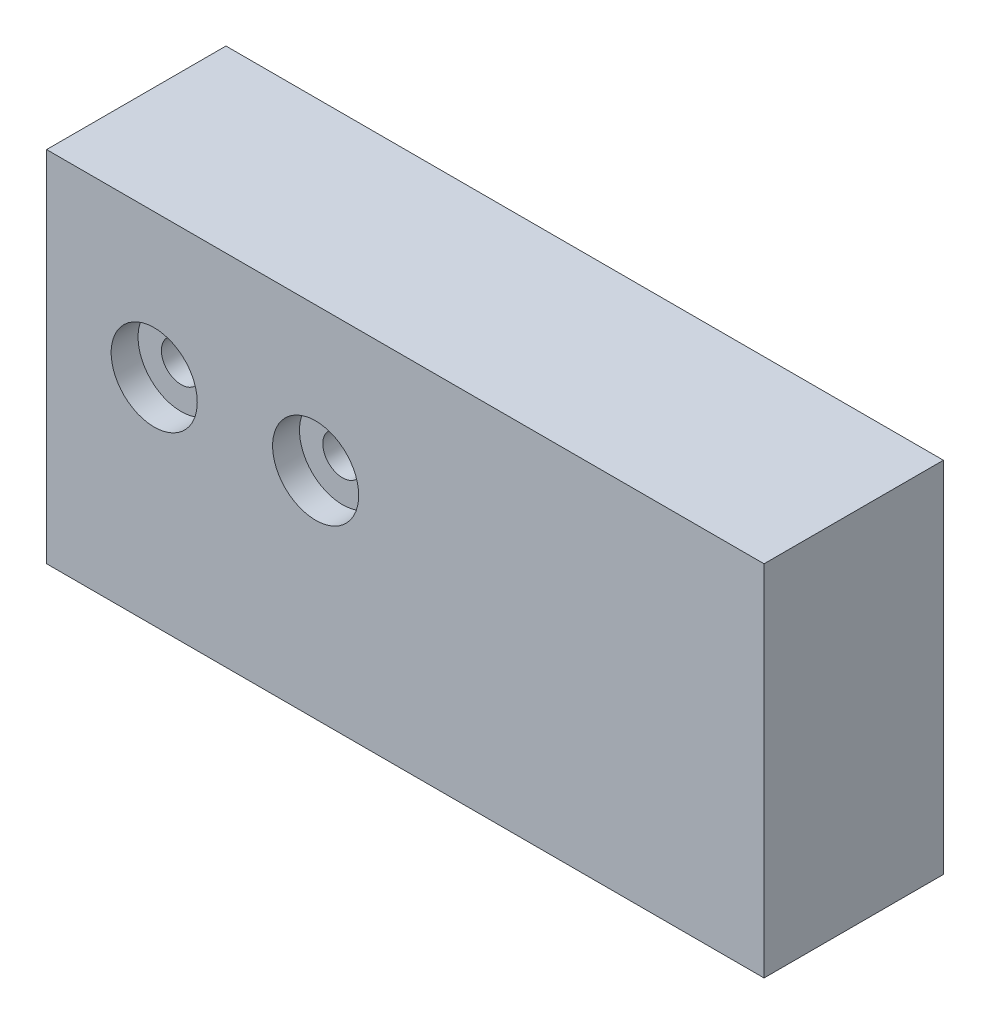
ISO-10303-21;
HEADER;
FILE_DESCRIPTION(('STEP AP214'),'2;1');
FILE_NAME('part.step','',(''),(''),'','','');
FILE_SCHEMA(('AUTOMOTIVE_DESIGN { 1 0 10303 214 1 1 1 1 }'));
ENDSEC;
DATA;
#1=APPLICATION_CONTEXT('core data for automotive mechanical design processes');
#2=APPLICATION_PROTOCOL_DEFINITION('international standard','automotive_design',2000,#1);
#3=PRODUCT_CONTEXT('',#1,'mechanical');
#4=PRODUCT('Part','Part','',(#3));
#5=PRODUCT_RELATED_PRODUCT_CATEGORY('part','',(#4));
#6=PRODUCT_DEFINITION_FORMATION('','',#4);
#7=PRODUCT_DEFINITION_CONTEXT('part definition',#1,'design');
#8=PRODUCT_DEFINITION('design','',#6,#7);
#9=PRODUCT_DEFINITION_SHAPE('','',#8);
#10=(LENGTH_UNIT() NAMED_UNIT(*) SI_UNIT(.MILLI.,.METRE.));
#11=(NAMED_UNIT(*) PLANE_ANGLE_UNIT() SI_UNIT($,.RADIAN.));
#12=(NAMED_UNIT(*) SI_UNIT($,.STERADIAN.) SOLID_ANGLE_UNIT());
#13=UNCERTAINTY_MEASURE_WITH_UNIT(LENGTH_MEASURE(1.E-05),#10,'distance_accuracy_value','');
#14=(GEOMETRIC_REPRESENTATION_CONTEXT(3) GLOBAL_UNCERTAINTY_ASSIGNED_CONTEXT((#13)) GLOBAL_UNIT_ASSIGNED_CONTEXT((#10,
#11,#12)) REPRESENTATION_CONTEXT('',''));
#15=CARTESIAN_POINT('',(0.,0.,0.));
#16=DIRECTION('',(0.,0.,1.));
#17=DIRECTION('',(1.,0.,0.));
#18=AXIS2_PLACEMENT_3D('',#15,#16,#17);
#19=CARTESIAN_POINT('',(-100.,-50.,50.));
#20=DIRECTION('',(1.,0.,0.));
#21=DIRECTION('',(0.,0.,-1.));
#22=AXIS2_PLACEMENT_3D('',#19,#20,#21);
#23=PLANE('',#22);
#24=DIRECTION('',(0.,-1.,0.));
#25=VECTOR('',#24,1.);
#26=CARTESIAN_POINT('',(-100.,-50.,0.));
#27=LINE('',#26,#25);
#28=CARTESIAN_POINT('',(-100.,50.,0.));
#29=VERTEX_POINT('',#28);
#30=CARTESIAN_POINT('',(-100.,-50.,0.));
#31=VERTEX_POINT('',#30);
#32=EDGE_CURVE('E98',#29,#31,#27,.T.);
#33=ORIENTED_EDGE('',*,*,#32,.T.);
#34=DIRECTION('',(0.,0.,-1.));
#35=VECTOR('',#34,1.);
#36=CARTESIAN_POINT('',(-100.,-50.,50.));
#37=LINE('',#36,#35);
#38=CARTESIAN_POINT('',(-100.,-50.,50.));
#39=VERTEX_POINT('',#38);
#40=EDGE_CURVE('E11',#39,#31,#37,.T.);
#41=ORIENTED_EDGE('',*,*,#40,.F.);
#42=DIRECTION('',(0.,-1.,0.));
#43=VECTOR('',#42,1.);
#44=CARTESIAN_POINT('',(-100.,-50.,50.));
#45=LINE('',#44,#43);
#46=CARTESIAN_POINT('',(-100.,50.,50.));
#47=VERTEX_POINT('',#46);
#48=EDGE_CURVE('E86',#47,#39,#45,.T.);
#49=ORIENTED_EDGE('',*,*,#48,.F.);
#50=DIRECTION('',(0.,0.,-1.));
#51=VECTOR('',#50,1.);
#52=CARTESIAN_POINT('',(-100.,50.,50.));
#53=LINE('',#52,#51);
#54=EDGE_CURVE('E94',#47,#29,#53,.T.);
#55=ORIENTED_EDGE('',*,*,#54,.T.);
#56=EDGE_LOOP('',(#33,#41,#49,#55));
#57=FACE_BOUND('',#56,.T.);
#58=ADVANCED_FACE('F35',(#57),#23,.F.);
#59=CARTESIAN_POINT('',(100.,-50.,50.));
#60=DIRECTION('',(0.,1.,0.));
#61=DIRECTION('',(-1.,0.,0.));
#62=AXIS2_PLACEMENT_3D('',#59,#60,#61);
#63=PLANE('',#62);
#64=DIRECTION('',(1.,0.,0.));
#65=VECTOR('',#64,1.);
#66=CARTESIAN_POINT('',(100.,-50.,0.));
#67=LINE('',#66,#65);
#68=CARTESIAN_POINT('',(100.,-50.,0.));
#69=VERTEX_POINT('',#68);
#70=EDGE_CURVE('E90',#31,#69,#67,.T.);
#71=ORIENTED_EDGE('',*,*,#70,.T.);
#72=DIRECTION('',(0.,0.,-1.));
#73=VECTOR('',#72,1.);
#74=CARTESIAN_POINT('',(100.,-50.,50.));
#75=LINE('',#74,#73);
#76=CARTESIAN_POINT('',(100.,-50.,50.));
#77=VERTEX_POINT('',#76);
#78=EDGE_CURVE('E43',#77,#69,#75,.T.);
#79=ORIENTED_EDGE('',*,*,#78,.F.);
#80=DIRECTION('',(1.,0.,0.));
#81=VECTOR('',#80,1.);
#82=CARTESIAN_POINT('',(100.,-50.,50.));
#83=LINE('',#82,#81);
#84=EDGE_CURVE('E81',#39,#77,#83,.T.);
#85=ORIENTED_EDGE('',*,*,#84,.F.);
#86=ORIENTED_EDGE('',*,*,#40,.T.);
#87=EDGE_LOOP('',(#71,#79,#85,#86));
#88=FACE_BOUND('',#87,.T.);
#89=ADVANCED_FACE('F89',(#88),#63,.F.);
#90=CARTESIAN_POINT('',(100.,-50.,50.));
#91=DIRECTION('',(-1.,0.,0.));
#92=DIRECTION('',(0.,0.,1.));
#93=AXIS2_PLACEMENT_3D('',#90,#91,#92);
#94=PLANE('',#93);
#95=DIRECTION('',(0.,1.,0.));
#96=VECTOR('',#95,1.);
#97=CARTESIAN_POINT('',(100.,-50.,0.));
#98=LINE('',#97,#96);
#99=CARTESIAN_POINT('',(100.,50.,0.));
#100=VERTEX_POINT('',#99);
#101=EDGE_CURVE('E68',#69,#100,#98,.T.);
#102=ORIENTED_EDGE('',*,*,#101,.T.);
#103=DIRECTION('',(0.,0.,-1.));
#104=VECTOR('',#103,1.);
#105=CARTESIAN_POINT('',(100.,50.,50.));
#106=LINE('',#105,#104);
#107=CARTESIAN_POINT('',(100.,50.,50.));
#108=VERTEX_POINT('',#107);
#109=EDGE_CURVE('E91',#108,#100,#106,.T.);
#110=ORIENTED_EDGE('',*,*,#109,.F.);
#111=DIRECTION('',(0.,1.,0.));
#112=VECTOR('',#111,1.);
#113=CARTESIAN_POINT('',(100.,-50.,50.));
#114=LINE('',#113,#112);
#115=EDGE_CURVE('E84',#77,#108,#114,.T.);
#116=ORIENTED_EDGE('',*,*,#115,.F.);
#117=ORIENTED_EDGE('',*,*,#78,.T.);
#118=EDGE_LOOP('',(#102,#110,#116,#117));
#119=FACE_BOUND('',#118,.T.);
#120=ADVANCED_FACE('F92',(#119),#94,.F.);
#121=CARTESIAN_POINT('',(100.,50.,50.));
#122=DIRECTION('',(0.,-1.,0.));
#123=DIRECTION('',(1.,0.,0.));
#124=AXIS2_PLACEMENT_3D('',#121,#122,#123);
#125=PLANE('',#124);
#126=DIRECTION('',(-1.,0.,0.));
#127=VECTOR('',#126,1.);
#128=CARTESIAN_POINT('',(100.,50.,0.));
#129=LINE('',#128,#127);
#130=EDGE_CURVE('E74',#100,#29,#129,.T.);
#131=ORIENTED_EDGE('',*,*,#130,.T.);
#132=ORIENTED_EDGE('',*,*,#54,.F.);
#133=DIRECTION('',(-1.,0.,0.));
#134=VECTOR('',#133,1.);
#135=CARTESIAN_POINT('',(100.,50.,50.));
#136=LINE('',#135,#134);
#137=EDGE_CURVE('E51',#108,#47,#136,.T.);
#138=ORIENTED_EDGE('',*,*,#137,.F.);
#139=ORIENTED_EDGE('',*,*,#109,.T.);
#140=EDGE_LOOP('',(#131,#132,#138,#139));
#141=FACE_BOUND('',#140,.T.);
#142=ADVANCED_FACE('F106',(#141),#125,.F.);
#143=CARTESIAN_POINT('',(0.,0.,50.));
#144=DIRECTION('',(0.,0.,1.));
#145=DIRECTION('',(1.,0.,0.));
#146=AXIS2_PLACEMENT_3D('',#143,#144,#145);
#147=PLANE('',#146);
#148=CARTESIAN_POINT('',(-70.,10.,50.));
#149=DIRECTION('',(0.,0.,1.));
#150=DIRECTION('',(1.,0.,0.));
#151=AXIS2_PLACEMENT_3D('',#148,#149,#150);
#152=CIRCLE('',#151,12.);
#153=CARTESIAN_POINT('',(-58.,10.,50.));
#154=VERTEX_POINT('',#153);
#155=EDGE_CURVE('E132',#154,#154,#152,.T.);
#156=ORIENTED_EDGE('',*,*,#155,.F.);
#157=EDGE_LOOP('',(#156));
#158=FACE_BOUND('',#157,.T.);
#159=CARTESIAN_POINT('',(-25.,10.,50.));
#160=DIRECTION('',(0.,0.,1.));
#161=DIRECTION('',(1.,0.,0.));
#162=AXIS2_PLACEMENT_3D('',#159,#160,#161);
#163=CIRCLE('',#162,12.);
#164=CARTESIAN_POINT('',(-13.,10.,50.));
#165=VERTEX_POINT('',#164);
#166=EDGE_CURVE('E120',#165,#165,#163,.T.);
#167=ORIENTED_EDGE('',*,*,#166,.F.);
#168=EDGE_LOOP('',(#167));
#169=FACE_BOUND('',#168,.T.);
#170=ORIENTED_EDGE('',*,*,#48,.T.);
#171=ORIENTED_EDGE('',*,*,#84,.T.);
#172=ORIENTED_EDGE('',*,*,#115,.T.);
#173=ORIENTED_EDGE('',*,*,#137,.T.);
#174=EDGE_LOOP('',(#170,#171,#172,#173));
#175=FACE_BOUND('',#174,.T.);
#176=ADVANCED_FACE('F82',(#158,#169,#175),#147,.T.);
#177=CARTESIAN_POINT('',(0.,0.,0.));
#178=DIRECTION('',(0.,0.,1.));
#179=DIRECTION('',(1.,0.,0.));
#180=AXIS2_PLACEMENT_3D('',#177,#178,#179);
#181=PLANE('',#180);
#182=CARTESIAN_POINT('',(-70.,10.,0.));
#183=DIRECTION('',(0.,0.,1.));
#184=DIRECTION('',(1.,0.,0.));
#185=AXIS2_PLACEMENT_3D('',#182,#183,#184);
#186=CIRCLE('',#185,5.49999999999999);
#187=CARTESIAN_POINT('',(-64.5,10.,0.));
#188=VERTEX_POINT('',#187);
#189=EDGE_CURVE('E123',#188,#188,#186,.T.);
#190=ORIENTED_EDGE('',*,*,#189,.T.);
#191=EDGE_LOOP('',(#190));
#192=FACE_BOUND('',#191,.T.);
#193=CARTESIAN_POINT('',(-25.,10.,0.));
#194=DIRECTION('',(0.,0.,1.));
#195=DIRECTION('',(1.,0.,0.));
#196=AXIS2_PLACEMENT_3D('',#193,#194,#195);
#197=CIRCLE('',#196,5.49999999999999);
#198=CARTESIAN_POINT('',(-19.5,10.,0.));
#199=VERTEX_POINT('',#198);
#200=EDGE_CURVE('E101',#199,#199,#197,.T.);
#201=ORIENTED_EDGE('',*,*,#200,.T.);
#202=EDGE_LOOP('',(#201));
#203=FACE_BOUND('',#202,.T.);
#204=ORIENTED_EDGE('',*,*,#32,.F.);
#205=ORIENTED_EDGE('',*,*,#130,.F.);
#206=ORIENTED_EDGE('',*,*,#101,.F.);
#207=ORIENTED_EDGE('',*,*,#70,.F.);
#208=EDGE_LOOP('',(#204,#205,#206,#207));
#209=FACE_BOUND('',#208,.T.);
#210=ADVANCED_FACE('F109',(#192,#203,#209),#181,.F.);
#211=CARTESIAN_POINT('',(-25.,10.,50.));
#212=DIRECTION('',(0.,0.,1.));
#213=DIRECTION('',(1.,0.,0.));
#214=AXIS2_PLACEMENT_3D('',#211,#212,#213);
#215=CYLINDRICAL_SURFACE('',#214,5.5);
#216=ORIENTED_EDGE('',*,*,#200,.F.);
#217=EDGE_LOOP('',(#216));
#218=FACE_BOUND('',#217,.T.);
#219=CARTESIAN_POINT('',(-25.,10.,42.5));
#220=DIRECTION('',(0.,0.,1.));
#221=DIRECTION('',(1.,0.,0.));
#222=AXIS2_PLACEMENT_3D('',#219,#220,#221);
#223=CIRCLE('',#222,5.50000000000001);
#224=CARTESIAN_POINT('',(-19.5,10.,42.5));
#225=VERTEX_POINT('',#224);
#226=EDGE_CURVE('E114',#225,#225,#223,.T.);
#227=ORIENTED_EDGE('',*,*,#226,.T.);
#228=EDGE_LOOP('',(#227));
#229=FACE_BOUND('',#228,.T.);
#230=ADVANCED_FACE('F156',(#218,#229),#215,.F.);
#231=CARTESIAN_POINT('',(-19.5,10.,42.5));
#232=DIRECTION('',(0.,0.,-1.));
#233=DIRECTION('',(-1.,0.,0.));
#234=AXIS2_PLACEMENT_3D('',#231,#232,#233);
#235=PLANE('',#234);
#236=ORIENTED_EDGE('',*,*,#226,.F.);
#237=EDGE_LOOP('',(#236));
#238=FACE_BOUND('',#237,.T.);
#239=CARTESIAN_POINT('',(-25.,10.,42.5));
#240=DIRECTION('',(0.,0.,1.));
#241=DIRECTION('',(1.,0.,0.));
#242=AXIS2_PLACEMENT_3D('',#239,#240,#241);
#243=CIRCLE('',#242,12.);
#244=CARTESIAN_POINT('',(-13.,10.,42.5));
#245=VERTEX_POINT('',#244);
#246=EDGE_CURVE('E117',#245,#245,#243,.T.);
#247=ORIENTED_EDGE('',*,*,#246,.T.);
#248=EDGE_LOOP('',(#247));
#249=FACE_BOUND('',#248,.T.);
#250=ADVANCED_FACE('F146',(#238,#249),#235,.F.);
#251=CARTESIAN_POINT('',(-25.,10.,50.));
#252=DIRECTION('',(0.,0.,1.));
#253=DIRECTION('',(1.,0.,0.));
#254=AXIS2_PLACEMENT_3D('',#251,#252,#253);
#255=CYLINDRICAL_SURFACE('',#254,12.);
#256=ORIENTED_EDGE('',*,*,#246,.F.);
#257=EDGE_LOOP('',(#256));
#258=FACE_BOUND('',#257,.T.);
#259=ORIENTED_EDGE('',*,*,#166,.T.);
#260=EDGE_LOOP('',(#259));
#261=FACE_BOUND('',#260,.T.);
#262=ADVANCED_FACE('F143',(#258,#261),#255,.F.);
#263=CARTESIAN_POINT('',(-70.,10.,50.));
#264=DIRECTION('',(0.,0.,1.));
#265=DIRECTION('',(1.,0.,0.));
#266=AXIS2_PLACEMENT_3D('',#263,#264,#265);
#267=CYLINDRICAL_SURFACE('',#266,5.5);
#268=ORIENTED_EDGE('',*,*,#189,.F.);
#269=EDGE_LOOP('',(#268));
#270=FACE_BOUND('',#269,.T.);
#271=CARTESIAN_POINT('',(-70.,10.,42.5));
#272=DIRECTION('',(0.,0.,1.));
#273=DIRECTION('',(1.,0.,0.));
#274=AXIS2_PLACEMENT_3D('',#271,#272,#273);
#275=CIRCLE('',#274,5.50000000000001);
#276=CARTESIAN_POINT('',(-64.5,10.,42.5));
#277=VERTEX_POINT('',#276);
#278=EDGE_CURVE('E126',#277,#277,#275,.T.);
#279=ORIENTED_EDGE('',*,*,#278,.T.);
#280=EDGE_LOOP('',(#279));
#281=FACE_BOUND('',#280,.T.);
#282=ADVANCED_FACE('F145',(#270,#281),#267,.F.);
#283=CARTESIAN_POINT('',(-64.5,10.,42.5));
#284=DIRECTION('',(0.,0.,-1.));
#285=DIRECTION('',(-1.,0.,0.));
#286=AXIS2_PLACEMENT_3D('',#283,#284,#285);
#287=PLANE('',#286);
#288=ORIENTED_EDGE('',*,*,#278,.F.);
#289=EDGE_LOOP('',(#288));
#290=FACE_BOUND('',#289,.T.);
#291=CARTESIAN_POINT('',(-70.,10.,42.5));
#292=DIRECTION('',(0.,0.,1.));
#293=DIRECTION('',(1.,0.,0.));
#294=AXIS2_PLACEMENT_3D('',#291,#292,#293);
#295=CIRCLE('',#294,12.);
#296=CARTESIAN_POINT('',(-58.,10.,42.5));
#297=VERTEX_POINT('',#296);
#298=EDGE_CURVE('E129',#297,#297,#295,.T.);
#299=ORIENTED_EDGE('',*,*,#298,.T.);
#300=EDGE_LOOP('',(#299));
#301=FACE_BOUND('',#300,.T.);
#302=ADVANCED_FACE('F153',(#290,#301),#287,.F.);
#303=CARTESIAN_POINT('',(-70.,10.,50.));
#304=DIRECTION('',(0.,0.,1.));
#305=DIRECTION('',(1.,0.,0.));
#306=AXIS2_PLACEMENT_3D('',#303,#304,#305);
#307=CYLINDRICAL_SURFACE('',#306,12.);
#308=ORIENTED_EDGE('',*,*,#298,.F.);
#309=EDGE_LOOP('',(#308));
#310=FACE_BOUND('',#309,.T.);
#311=ORIENTED_EDGE('',*,*,#155,.T.);
#312=EDGE_LOOP('',(#311));
#313=FACE_BOUND('',#312,.T.);
#314=ADVANCED_FACE('F136',(#310,#313),#307,.F.);
#315=CLOSED_SHELL('',(#58,#89,#120,#142,#176,#210,#230,#250,#262,#282,#302,#314));
#316=MANIFOLD_SOLID_BREP('B2',#315);
#317=ADVANCED_BREP_SHAPE_REPRESENTATION('',(#18,#316),#14);
#318=SHAPE_DEFINITION_REPRESENTATION(#9,#317);
ENDSEC;
END-ISO-10303-21;
